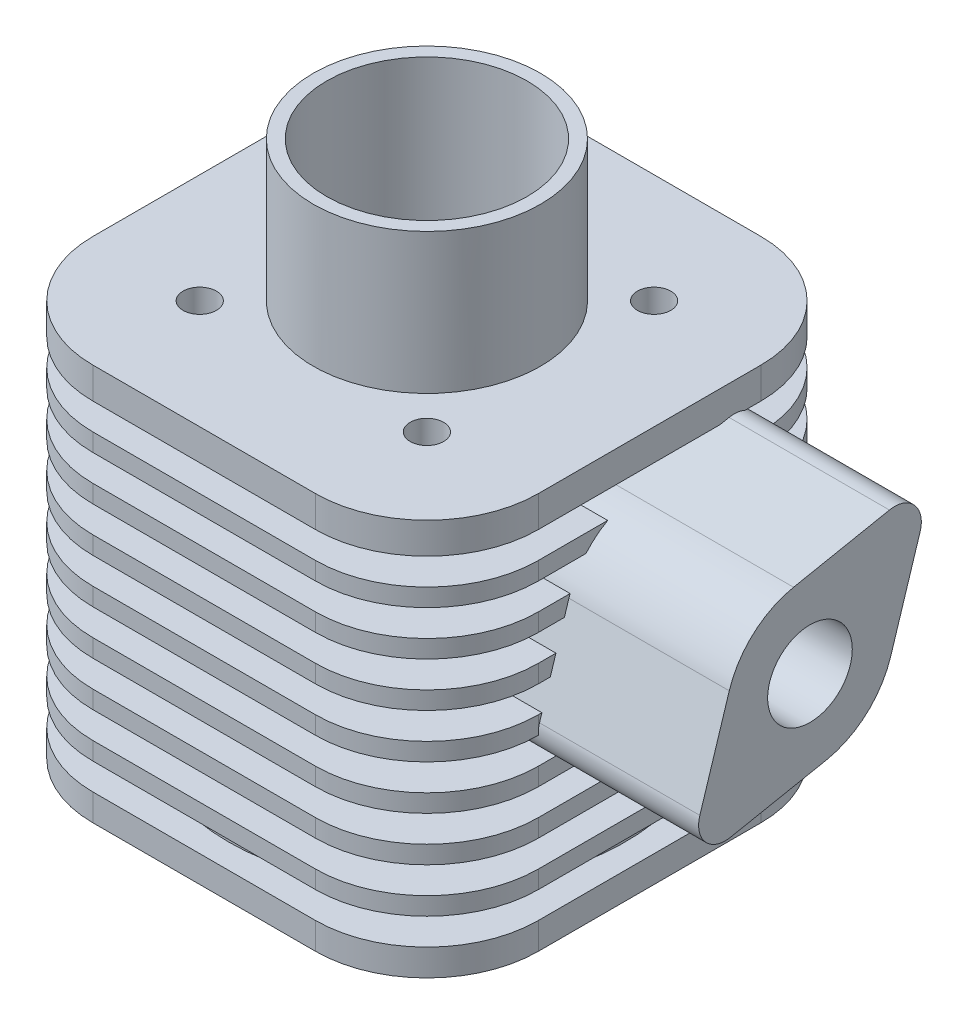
from build123d import *

# Parameters (mm, degrees)
BOSS_EXTRUDE1_DEPTH      = 114
BOSS_EXTRUDE1_DEPTH_BACK = 64
SKETCH2_R                = 45
CUT_EXTRUDE1_DEPTH       = 228.341153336
BOSS_EXTRUDE2_START      = 63
SKETCH3_R                = 51
SKETCH3_R_2              = 45
BOSS_EXTRUDE2_DEPTH      = 63
SKETCH6_W                = 38
SKETCH6_H                = 12
SKETCH7_W                = 38
SKETCH7_H                = 12
LPATTERN2_COUNT          = 7
LPATTERN2_PITCH          = 20
SKETCH8_R                = 45
SKETCH8_R_2              = 7.5
BOSS_EXTRUDE3_DEPTH      = 6.5
SKETCH9_R                = 7.5
CUT_EXTRUDE2_DEPTH       = 286.054819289
BOSS_EXTRUDE4_REACH      = 341.578
BOSS_EXTRUDE4_END_RADIUS = 88
SKETCH10_R               = 19
CUT_EXTRUDE3_REACH       = 341.578
SKETCH11_R               = 19


with BuildPart() as part:
    # Sketch1 → Boss-Extrude1 (new, two sides: drawn at the far end of the back side and taken through both)
    with BuildSketch(Plane(origin=(0, 0, 0), x_dir=(1, 0, 0), z_dir=(0, 1, 0)).offset(-BOSS_EXTRUDE1_DEPTH_BACK)):
        with BuildLine():
            Line((-50, 100), (50, 100))
            ThreePointArc((50, 100), (85.355339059, 85.355339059), (100, 50))
            Line((100, 50), (100, -50))
            ThreePointArc((100, -50), (85.355339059, -85.355339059), (50, -100))
            Line((50, -100), (-50, -100))
            ThreePointArc((-50, -100), (-85.355339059, -85.355339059), (-100, -50))
            Line((-100, -50), (-100, 50))
            ThreePointArc((-100, 50), (-85.355339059, 85.355339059), (-50, 100))
        make_face()
    extrude(amount=BOSS_EXTRUDE1_DEPTH + BOSS_EXTRUDE1_DEPTH_BACK)

    # Sketch2 → Cut-Extrude1 (cut, through all)
    with BuildSketch(Plane(origin=(0, 114, 0), x_dir=(1, 0, 0), z_dir=(0, 1, 0))):
        with Locations(Location((0, 0, 0), (0, 0, 270))):
            Circle(SKETCH2_R)
    extrude(amount=-CUT_EXTRUDE1_DEPTH, mode=Mode.SUBTRACT)

    # Sketch3 → Boss-Extrude2 (add)
    with BuildSketch(Plane(origin=(0, 114, 0), x_dir=(1, 0, 0), z_dir=(0, 1, 0)).offset(BOSS_EXTRUDE2_START)):
        with Locations(Location((0, 0, 0), (0, 0, 90))):
            Circle(SKETCH3_R)
        with Locations(Location((0, 0, 0), (0, 0, 270))):
            Circle(SKETCH3_R_2, mode=Mode.SUBTRACT)
    extrude(amount=-BOSS_EXTRUDE2_DEPTH)

    # Sketch6 → Cut-Revolve1 (revolve, cut)
    with BuildSketch(Plane.XY, mode=Mode.PRIVATE) as cut_revolve1_sk:
        with Locations((108, -46)):
            Rectangle(SKETCH6_W, SKETCH6_H)
    revolve(cut_revolve1_sk.sketch.rotate(Axis((0, 0, 0), (0, -1, 0)), 90), axis=Axis((0, 0, 0), (0, -1, 0)), mode=Mode.SUBTRACT)

    # Sketch7 → Cut-Revolve3 (revolve, cut)
    with BuildSketch(Plane.XY, mode=Mode.PRIVATE) as cut_revolve3_sk:
        with Locations((107, -26)):
            Rectangle(SKETCH7_W, SKETCH7_H)
    cut_revolve3 = revolve(cut_revolve3_sk.sketch.rotate(Axis((0, 0, 0), (0, -1, 0)), 90), axis=Axis((0, 0, 0), (0, -1, 0)), mode=Mode.SUBTRACT)

    # LPattern2: Cut-Revolve3 ×7
    with Locations(*[(0, i * LPATTERN2_PITCH, 0) for i in range(1, LPATTERN2_COUNT)]):
        add(cut_revolve3, mode=Mode.SUBTRACT)

    # Sketch8 → Boss-Extrude3 (add)
    with BuildSketch(Plane.XZ.offset(64)):
        with BuildLine():
            ThreePointArc((61.198182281, 44.675675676), (59.485281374, 59.485281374), (44.675675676, 61.198182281))
            ThreePointArc((44.675675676, 61.198182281), (35.807754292, 57.818326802), (26.319078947, 57.987125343))
            ThreePointArc((26.319078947, 57.987125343), (0, 60.744193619), (-26.319078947, 57.987125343))
            ThreePointArc((-26.319078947, 57.987125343), (-35.807754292, 57.818326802), (-44.675675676, 61.198182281))
            ThreePointArc((-44.675675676, 61.198182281), (-59.485281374, 59.485281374), (-61.198182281, 44.675675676))
            ThreePointArc((-61.198182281, 44.675675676), (-57.818326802, 35.807754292), (-57.987125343, 26.319078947))
            ThreePointArc((-57.987125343, 26.319078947), (-60.744193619, 0), (-57.987125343, -26.319078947))
            ThreePointArc((-57.987125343, -26.319078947), (-57.818326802, -35.807754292), (-61.198182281, -44.675675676))
            ThreePointArc((-61.198182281, -44.675675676), (-59.485281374, -59.485281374), (-44.675675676, -61.198182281))
            ThreePointArc((-44.675675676, -61.198182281), (-35.807754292, -57.818326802), (-26.319078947, -57.987125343))
            ThreePointArc((-26.319078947, -57.987125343), (0, -60.744193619), (26.319078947, -57.987125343))
            ThreePointArc((26.319078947, -57.987125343), (35.807754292, -57.818326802), (44.675675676, -61.198182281))
            ThreePointArc((44.675675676, -61.198182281), (59.485281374, -59.485281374), (61.198182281, -44.675675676))
            ThreePointArc((61.198182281, -44.675675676), (57.818326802, -35.807754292), (57.987125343, -26.319078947))
            ThreePointArc((57.987125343, -26.319078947), (60.744193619, 0), (57.987125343, 26.319078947))
            ThreePointArc((57.987125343, 26.319078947), (57.818326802, 35.807754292), (61.198182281, 44.675675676))
        make_face()
        with Locations(Location((0, 0, 0), (0, 0, 90))):
            Circle(SKETCH8_R, mode=Mode.SUBTRACT)
        with Locations(Location((51, 51, 0), (0, 0, 90))):
            Circle(SKETCH8_R_2, mode=Mode.SUBTRACT)
        with Locations(Location((-51, 51, 0), (0, 0, 90))):
            Circle(SKETCH8_R_2, mode=Mode.SUBTRACT)
        with Locations(Location((-51, -51, 0), (0, 0, 90))):
            Circle(SKETCH8_R_2, mode=Mode.SUBTRACT)
        with Locations(Location((51, -51, 0), (0, 0, 90))):
            Circle(SKETCH8_R_2, mode=Mode.SUBTRACT)
    extrude(amount=BOSS_EXTRUDE3_DEPTH)

    # Sketch9 → Cut-Extrude2 (cut, through all)
    with BuildSketch(Plane.XZ.offset(70.5)):
        with Locations(Location((-51, 51, 0), (0, 0, 90))):
            Circle(SKETCH9_R)
        with Locations(Location((-51, -51, 0), (0, 0, 90))):
            Circle(SKETCH9_R)
        with Locations(Location((51, -51, 0), (0, 0, 90))):
            Circle(SKETCH9_R)
        with Locations(Location((51, 51, 0), (0, 0, 90))):
            Circle(SKETCH9_R)
    extrude(amount=-CUT_EXTRUDE2_DEPTH, mode=Mode.SUBTRACT)

    # Boss-Extrude4: up to this cylinder (the profile starts outside it)
    boss_extrude4_end = Plane(origin=(0, 64.891781, 0), z_dir=(0, 1, 0)) * Cylinder(BOSS_EXTRUDE4_END_RADIUS, 860.156, mode=Mode.PRIVATE)
    # Sketch10 → Boss-Extrude4 (add, up to the surface)
    with BuildSketch(Plane(origin=(172, 0, 0), x_dir=(0, 0, -1), z_dir=(1, 0, 0)), mode=Mode.PRIVATE) as boss_extrude4_sk1:
        with BuildLine():
            Line((35.672945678, 100.786908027), (-7.369005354, 92.278650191))
            ThreePointArc((-7.369005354, 92.278650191), (-25.344288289, 83.31372549), (-36.237901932, 66.437415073))
            Line((-36.237901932, 66.437415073), (-49.443547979, 24.597112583))
            ThreePointArc((-49.443547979, 24.597112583), (-46.941176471, 12.981837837), (-35.672945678, 9.213091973))
            Line((-35.672945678, 9.213091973), (7.369005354, 17.721349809))
            ThreePointArc((7.369005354, 17.721349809), (25.344288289, 26.68627451), (36.237901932, 43.562584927))
            Line((36.237901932, 43.562584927), (49.443547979, 85.402887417))
            ThreePointArc((49.443547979, 85.402887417), (46.941176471, 97.018162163), (35.672945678, 100.786908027))
        make_face()
        with Locations((0, 55)):
            Circle(SKETCH10_R, mode=Mode.SUBTRACT)
    boss_extrude4_tool1 = extrude(boss_extrude4_sk1.sketch, amount=-BOSS_EXTRUDE4_REACH, mode=Mode.PRIVATE) - boss_extrude4_end
    add(boss_extrude4_tool1.solids().sort_by_distance((172, 64.891781, -41.544722))[0])

    # Sketch11 → Cut-Extrude3 (cut, up to next)
    with BuildSketch(Plane(origin=(172, 0, 0), x_dir=(0, 0, -1), z_dir=(1, 0, 0)), mode=Mode.PRIVATE) as cut_extrude3_sk1:
        with Locations((0, 55)):
            Circle(SKETCH11_R)
    cut_extrude3_tool1 = extrude(cut_extrude3_sk1.sketch, amount=-CUT_EXTRUDE3_REACH, mode=Mode.PRIVATE) & part.part
    add(cut_extrude3_tool1.solids().sort_by_distance((172, 55, 0))[0], mode=Mode.SUBTRACT)


solid = part.part
